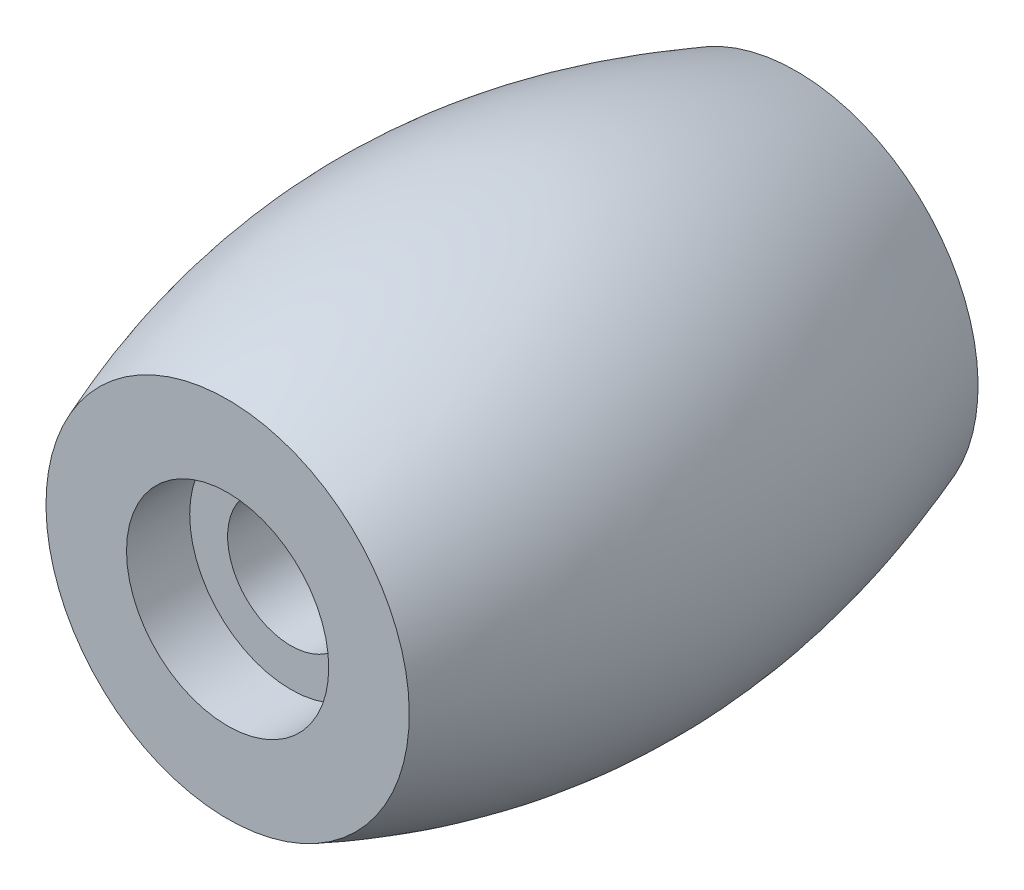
ISO-10303-21;
HEADER;
FILE_DESCRIPTION(('STEP AP214'),'2;1');
FILE_NAME('part.step','',(''),(''),'','','');
FILE_SCHEMA(('AUTOMOTIVE_DESIGN { 1 0 10303 214 1 1 1 1 }'));
ENDSEC;
DATA;
#1=APPLICATION_CONTEXT('core data for automotive mechanical design processes');
#2=APPLICATION_PROTOCOL_DEFINITION('international standard','automotive_design',2000,#1);
#3=PRODUCT_CONTEXT('',#1,'mechanical');
#4=PRODUCT('Part','Part','',(#3));
#5=PRODUCT_RELATED_PRODUCT_CATEGORY('part','',(#4));
#6=PRODUCT_DEFINITION_FORMATION('','',#4);
#7=PRODUCT_DEFINITION_CONTEXT('part definition',#1,'design');
#8=PRODUCT_DEFINITION('design','',#6,#7);
#9=PRODUCT_DEFINITION_SHAPE('','',#8);
#10=(LENGTH_UNIT() NAMED_UNIT(*) SI_UNIT(.MILLI.,.METRE.));
#11=(NAMED_UNIT(*) PLANE_ANGLE_UNIT() SI_UNIT($,.RADIAN.));
#12=(NAMED_UNIT(*) SI_UNIT($,.STERADIAN.) SOLID_ANGLE_UNIT());
#13=UNCERTAINTY_MEASURE_WITH_UNIT(LENGTH_MEASURE(1.E-05),#10,'distance_accuracy_value','');
#14=(GEOMETRIC_REPRESENTATION_CONTEXT(3) GLOBAL_UNCERTAINTY_ASSIGNED_CONTEXT((#13)) GLOBAL_UNIT_ASSIGNED_CONTEXT((#10,
#11,#12)) REPRESENTATION_CONTEXT('',''));
#15=CARTESIAN_POINT('',(0.,0.,0.));
#16=DIRECTION('',(0.,0.,1.));
#17=DIRECTION('',(1.,0.,0.));
#18=AXIS2_PLACEMENT_3D('',#15,#16,#17);
#19=CARTESIAN_POINT('',(4.,8.25,-5.5));
#20=DIRECTION('',(0.,0.,1.));
#21=DIRECTION('',(1.,0.,0.));
#22=AXIS2_PLACEMENT_3D('',#19,#20,#21);
#23=CYLINDRICAL_SURFACE('',#22,1.);
#24=CARTESIAN_POINT('',(4.,8.25,3.5));
#25=DIRECTION('',(0.,0.,1.));
#26=DIRECTION('',(1.,0.,0.));
#27=AXIS2_PLACEMENT_3D('',#24,#25,#26);
#28=CIRCLE('',#27,1.);
#29=CARTESIAN_POINT('',(5.,8.25,3.5));
#30=VERTEX_POINT('',#29);
#31=EDGE_CURVE('E104',#30,#30,#28,.F.);
#32=ORIENTED_EDGE('',*,*,#31,.F.);
#33=EDGE_LOOP('',(#32));
#34=FACE_BOUND('',#33,.T.);
#35=CARTESIAN_POINT('',(4.,8.25,-3.5));
#36=DIRECTION('',(0.,0.,-1.));
#37=DIRECTION('',(-1.,0.,0.));
#38=AXIS2_PLACEMENT_3D('',#35,#36,#37);
#39=CIRCLE('',#38,1.);
#40=CARTESIAN_POINT('',(3.,8.25,-3.5));
#41=VERTEX_POINT('',#40);
#42=EDGE_CURVE('E92',#41,#41,#39,.F.);
#43=ORIENTED_EDGE('',*,*,#42,.F.);
#44=EDGE_LOOP('',(#43));
#45=FACE_BOUND('',#44,.T.);
#46=ADVANCED_FACE('F87',(#34,#45),#23,.F.);
#47=CARTESIAN_POINT('',(4.,8.25,-4.5));
#48=DIRECTION('',(0.,0.,1.));
#49=DIRECTION('',(1.,0.,0.));
#50=AXIS2_PLACEMENT_3D('',#47,#48,#49);
#51=PLANE('',#50);
#52=CARTESIAN_POINT('',(4.,8.25,-4.5));
#53=DIRECTION('',(0.,0.,1.));
#54=DIRECTION('',(1.,0.,0.));
#55=AXIS2_PLACEMENT_3D('',#52,#53,#54);
#56=CIRCLE('',#55,1.6);
#57=CARTESIAN_POINT('',(5.6,8.25,-4.5));
#58=VERTEX_POINT('',#57);
#59=EDGE_CURVE('E127',#58,#58,#56,.T.);
#60=ORIENTED_EDGE('',*,*,#59,.T.);
#61=EDGE_LOOP('',(#60));
#62=FACE_BOUND('',#61,.T.);
#63=CARTESIAN_POINT('',(4.,8.25,-4.5));
#64=DIRECTION('',(0.,0.,1.));
#65=DIRECTION('',(1.,0.,0.));
#66=AXIS2_PLACEMENT_3D('',#63,#64,#65);
#67=CIRCLE('',#66,2.87429773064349);
#68=CARTESIAN_POINT('',(5.19432510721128,5.63558324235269,-4.5));
#69=VERTEX_POINT('',#68);
#70=EDGE_CURVE('E11',#69,#69,#67,.T.);
#71=ORIENTED_EDGE('',*,*,#70,.F.);
#72=EDGE_LOOP('',(#71));
#73=FACE_BOUND('',#72,.T.);
#74=ADVANCED_FACE('F89',(#62,#73),#51,.F.);
#75=CARTESIAN_POINT('',(4.,8.25,4.5));
#76=DIRECTION('',(0.,0.,1.));
#77=DIRECTION('',(1.,0.,0.));
#78=AXIS2_PLACEMENT_3D('',#75,#76,#77);
#79=PLANE('',#78);
#80=CARTESIAN_POINT('',(4.,8.25,4.5));
#81=DIRECTION('',(0.,0.,1.));
#82=DIRECTION('',(1.,0.,0.));
#83=AXIS2_PLACEMENT_3D('',#80,#81,#82);
#84=CIRCLE('',#83,1.6);
#85=CARTESIAN_POINT('',(5.6,8.25,4.5));
#86=VERTEX_POINT('',#85);
#87=EDGE_CURVE('E119',#86,#86,#84,.T.);
#88=ORIENTED_EDGE('',*,*,#87,.F.);
#89=EDGE_LOOP('',(#88));
#90=FACE_BOUND('',#89,.T.);
#91=CARTESIAN_POINT('',(4.,8.25,4.5));
#92=DIRECTION('',(0.,0.,1.));
#93=DIRECTION('',(1.,0.,0.));
#94=AXIS2_PLACEMENT_3D('',#91,#92,#93);
#95=CIRCLE('',#94,2.87429773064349);
#96=CARTESIAN_POINT('',(6.02090983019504,6.20610398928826,4.5));
#97=VERTEX_POINT('',#96);
#98=EDGE_CURVE('E97',#97,#97,#95,.T.);
#99=ORIENTED_EDGE('',*,*,#98,.T.);
#100=EDGE_LOOP('',(#99));
#101=FACE_BOUND('',#100,.T.);
#102=ADVANCED_FACE('F148',(#90,#101),#79,.T.);
#103=CARTESIAN_POINT('',(6.02090983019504,6.20610398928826,4.5));
#104=CARTESIAN_POINT('',(6.34296508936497,5.68791517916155,2.99234261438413));
#105=CARTESIAN_POINT('',(6.52667954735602,5.07422380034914,-0.0217139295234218));
#106=CARTESIAN_POINT('',(5.7919086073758,5.30756801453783,-3.00765738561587));
#107=CARTESIAN_POINT('',(5.19432510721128,5.63558324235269,-4.5));
#108=CARTESIAN_POINT('',(5.75336448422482,5.94156752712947,4.5));
#109=CARTESIAN_POINT('',(6.00759965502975,5.38122927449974,2.99234251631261));
#110=CARTESIAN_POINT('',(6.11096171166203,4.74347339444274,-0.0217138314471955));
#111=CARTESIAN_POINT('',(5.40675395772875,5.07301796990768,-3.00765748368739));
#112=CARTESIAN_POINT('',(4.85209877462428,5.47924646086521,-4.5));
#113=CARTESIAN_POINT('',(5.11324565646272,5.51885815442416,4.50000000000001));
#114=CARTESIAN_POINT('',(5.21506756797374,4.90120104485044,2.99234145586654));
#115=CARTESIAN_POINT('',(5.14825749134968,4.24734078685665,-0.0217127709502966));
#116=CARTESIAN_POINT('',(4.54332108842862,4.75701315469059,-3.00765854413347));
#117=CARTESIAN_POINT('',(4.10562462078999,5.3025782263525,-4.5));
#118=CARTESIAN_POINT('',(3.98326975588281,5.30084531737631,4.49999999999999));
#119=CARTESIAN_POINT('',(3.84098632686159,4.69120406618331,2.99234079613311));
#120=CARTESIAN_POINT('',(3.52903888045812,4.11264335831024,-0.0217121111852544));
#121=CARTESIAN_POINT('',(3.1652232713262,4.81507196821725,-3.00765920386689));
#122=CARTESIAN_POINT('',(2.96962552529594,5.48664665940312,-4.5));
#123=CARTESIAN_POINT('',(2.85600716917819,5.53168464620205,4.5));
#124=CARTESIAN_POINT('',(2.49124487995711,5.02291413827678,2.99234192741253));
#125=CARTESIAN_POINT('',(1.98162919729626,4.60778546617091,-0.0217132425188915));
#126=CARTESIAN_POINT('',(1.91430886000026,5.39594522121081,-3.00765807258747));
#127=CARTESIAN_POINT('',(1.99060304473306,6.09123140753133,-4.5));
#128=CARTESIAN_POINT('',(1.90281145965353,6.17641048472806,4.5));
#129=CARTESIAN_POINT('',(1.37111204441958,5.84596081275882,2.99234210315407));
#130=CARTESIAN_POINT('',(0.74142053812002,5.65745854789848,-0.0217134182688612));
#131=CARTESIAN_POINT('',(0.980850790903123,6.41138501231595,-3.00765789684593));
#132=CARTESIAN_POINT('',(1.31741960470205,7.02454674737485,-4.5));
#133=CARTESIAN_POINT('',(1.2689346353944,7.13680475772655,4.50000000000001));
#134=CARTESIAN_POINT('',(0.651253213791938,7.03497944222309,2.99234220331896));
#135=CARTESIAN_POINT('',(-0.00264040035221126,7.10179591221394,-0.0217135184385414));
#136=CARTESIAN_POINT('',(0.507075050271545,7.70670719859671,-3.00765779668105));
#137=CARTESIAN_POINT('',(1.05266738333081,8.14439640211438,-4.5));
#138=CARTESIAN_POINT('',(1.05082430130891,8.26665473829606,4.49999999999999));
#139=CARTESIAN_POINT('',(0.441184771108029,8.40898620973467,2.99234360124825));
#140=CARTESIAN_POINT('',(-0.137375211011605,8.72098074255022,-0.0217149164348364));
#141=CARTESIAN_POINT('',(0.565035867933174,9.08475692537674,-3.00765639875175));
#142=CARTESIAN_POINT('',(1.23660094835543,9.28031080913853,-4.50000000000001));
#143=CARTESIAN_POINT('',(1.28166069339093,9.39400184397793,4.5));
#144=CARTESIAN_POINT('',(0.772921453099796,9.75874989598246,2.99234229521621));
#145=CARTESIAN_POINT('',(0.357824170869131,10.268353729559,-0.0217136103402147));
#146=CARTESIAN_POINT('',(1.14595566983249,10.3356911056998,-3.00765770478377));
#147=CARTESIAN_POINT('',(1.84121201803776,10.2594136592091,-4.49999999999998));
#148=CARTESIAN_POINT('',(1.92642056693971,10.3471646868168,4.5));
#149=CARTESIAN_POINT('',(1.59595827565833,10.8788762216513,2.99234215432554));
#150=CARTESIAN_POINT('',(1.40744213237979,11.5085792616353,-0.0217134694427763));
#151=CARTESIAN_POINT('',(2.16137656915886,11.2691361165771,-3.00765784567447));
#152=CARTESIAN_POINT('',(2.7745480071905,10.9325545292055,-4.50000000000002));
#153=CARTESIAN_POINT('',(2.8868143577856,10.9811035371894,4.5));
#154=CARTESIAN_POINT('',(2.78500125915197,11.598752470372,2.99234185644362));
#155=CARTESIAN_POINT('',(2.85183187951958,12.2526125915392,-0.0217131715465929));
#156=CARTESIAN_POINT('',(3.45673738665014,11.7429268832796,-3.00765814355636));
#157=CARTESIAN_POINT('',(3.89441854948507,11.1973651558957,-4.49999999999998));
#158=CARTESIAN_POINT('',(4.01670000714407,11.199175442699,4.5));
#159=CARTESIAN_POINT('',(4.15897694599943,11.8088208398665,2.99234056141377));
#160=CARTESIAN_POINT('',(4.47091548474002,12.3873842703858,-0.0217118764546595));
#161=CARTESIAN_POINT('',(4.8347457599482,11.6849593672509,-3.00765943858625));
#162=CARTESIAN_POINT('',(5.03035322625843,11.0133832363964,-4.50000000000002));
#163=CARTESIAN_POINT('',(5.14401101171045,10.9683010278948,4.5));
#164=CARTESIAN_POINT('',(5.5087772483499,11.4770685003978,2.9923420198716));
#165=CARTESIAN_POINT('',(6.01839685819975,11.8921939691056,-0.021713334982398));
#166=CARTESIAN_POINT('',(6.08570930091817,11.1040337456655,-3.00765798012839));
#167=CARTESIAN_POINT('',(6.00940909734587,10.4087488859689,-4.49999999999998));
#168=CARTESIAN_POINT('',(6.09717503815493,10.3236031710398,4.5));
#169=CARTESIAN_POINT('',(6.62887232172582,10.6540562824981,2.99234207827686));
#170=CARTESIAN_POINT('',(7.2585626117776,10.8425626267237,-0.0217133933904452));
#171=CARTESIAN_POINT('',(7.01913725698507,10.0886346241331,-3.00765792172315));
#172=CARTESIAN_POINT('',(6.68257241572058,9.47547072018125,-4.50000000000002));
#173=CARTESIAN_POINT('',(6.73107948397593,9.36317690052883,4.5));
#174=CARTESIAN_POINT('',(7.34876201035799,9.46499707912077,2.99234220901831));
#175=CARTESIAN_POINT('',(8.00265457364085,9.39817410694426,-0.021713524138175));
#176=CARTESIAN_POINT('',(7.49293533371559,8.79326691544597,-3.00765779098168));
#177=CARTESIAN_POINT('',(6.94733956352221,8.35558151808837,-4.49999999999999));
#178=CARTESIAN_POINT('',(6.94915528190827,8.23337573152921,4.5));
#179=CARTESIAN_POINT('',(7.5587937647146,8.09105245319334,2.9923436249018));
#180=CARTESIAN_POINT('',(8.13735849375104,7.77906992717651,-0.0217149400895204));
#181=CARTESIAN_POINT('',(7.43495072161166,7.41528484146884,-3.0076563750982));
#182=CARTESIAN_POINT('',(6.76339036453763,7.21972482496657,-4.50000000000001));
#183=CARTESIAN_POINT('',(6.7183769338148,7.10593771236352,4.5));
#184=CARTESIAN_POINT('',(7.22711937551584,6.7411772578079,2.99234204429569));
#185=CARTESIAN_POINT('',(7.64220163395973,6.23154846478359,-0.0217133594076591));
#186=CARTESIAN_POINT('',(6.85406888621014,6.16423114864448,-3.0076579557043));
#187=CARTESIAN_POINT('',(6.1588025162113,6.2405166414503,-4.49999999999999));
#188=CARTESIAN_POINT('',(6.28845517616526,6.47064045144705,4.5));
#189=CARTESIAN_POINT('',(6.67833052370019,5.99460108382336,2.99234271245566));
#190=CARTESIAN_POINT('',(6.94239738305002,5.40497420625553,-0.0217140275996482));
#191=CARTESIAN_POINT('',(6.17706325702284,5.54211805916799,-3.00765728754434));
#192=CARTESIAN_POINT('',(5.53655143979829,5.79192002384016,-4.5));
#193=CARTESIAN_POINT('',(6.02090983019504,6.20610398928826,4.5));
#194=CARTESIAN_POINT('',(6.34296508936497,5.68791517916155,2.99234261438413));
#195=CARTESIAN_POINT('',(6.52667954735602,5.07422380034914,-0.0217139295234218));
#196=CARTESIAN_POINT('',(5.7919086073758,5.30756801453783,-3.00765738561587));
#197=CARTESIAN_POINT('',(5.19432510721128,5.63558324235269,-4.5));
#198=B_SPLINE_SURFACE_WITH_KNOTS('',3,3,((#103,#104,#105,#106,#107),(#108,#109,#110,#111,#112),
(#113,#114,#115,#116,#117),(#118,#119,#120,#121,#122),(#123,#124,#125,#126,#127),(#128,#129,
#130,#131,#132),(#133,#134,#135,#136,#137),(#138,#139,#140,#141,#142),(#143,#144,#145,#146,
#147),(#148,#149,#150,#151,#152),(#153,#154,#155,#156,#157),(#158,#159,#160,#161,#162),(#163,
#164,#165,#166,#167),(#168,#169,#170,#171,#172),(#173,#174,#175,#176,#177),(#178,#179,#180,#181,
#182),(#183,#184,#185,#186,#187),(#188,#189,#190,#191,#192),(#193,#194,#195,#196,#197)),
.UNSPECIFIED.,.T.,.F.,.F.,(4,1,1,1,1,1,1,1,1,1,1,1,1,1,1,1,4),(4,1,4),(0.,0.0625,0.125,0.1875,
0.25,0.3125,0.375,0.4375,0.5,0.5625,0.625,0.6875,0.75,0.8125,0.875,0.9375,1.),(0.,
0.497552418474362,1.),.UNSPECIFIED.);
#199=CARTESIAN_POINT('',(6.02090983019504,6.20610398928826,4.5));
#200=CARTESIAN_POINT('',(6.02343679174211,6.20203809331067,4.48817037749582));
#201=CARTESIAN_POINT('',(6.02595102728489,6.19798292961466,4.47633434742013));
#202=CARTESIAN_POINT('',(6.0309510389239,6.18989886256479,4.45266325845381));
#203=CARTESIAN_POINT('',(6.03343684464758,6.18586993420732,4.44082821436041));
#204=CARTESIAN_POINT('',(6.03837999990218,6.17783833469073,4.41715909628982));
#205=CARTESIAN_POINT('',(6.04083737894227,6.17383563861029,4.40532503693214));
#206=CARTESIAN_POINT('',(6.04572368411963,6.16585650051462,4.38165788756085));
#207=CARTESIAN_POINT('',(6.04815263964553,6.16188003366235,4.36982481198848));
#208=CARTESIAN_POINT('',(6.05298210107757,6.15395335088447,4.34615962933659));
#209=CARTESIAN_POINT('',(6.05538263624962,6.1500031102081,4.33432753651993));
#210=CARTESIAN_POINT('',(6.06015526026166,6.1421288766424,4.31066431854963));
#211=CARTESIAN_POINT('',(6.06252737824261,6.13820485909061,4.2988332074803));
#212=CARTESIAN_POINT('',(6.06724317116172,6.13038306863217,4.27517195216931));
#213=CARTESIAN_POINT('',(6.06958687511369,6.12648527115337,4.26334182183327));
#214=CARTESIAN_POINT('',(6.07424584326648,6.11871591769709,4.23968252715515));
#215=CARTESIAN_POINT('',(6.07656113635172,6.11484433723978,4.2278533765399));
#216=CARTESIAN_POINT('',(6.08116328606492,6.10712741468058,4.20419604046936));
#217=CARTESIAN_POINT('',(6.08345017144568,6.10328204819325,4.19236786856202));
#218=CARTESIAN_POINT('',(6.08799550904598,6.09561755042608,4.16871248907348));
#219=CARTESIAN_POINT('',(6.09025398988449,6.0917983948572,4.15688529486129));
#220=CARTESIAN_POINT('',(6.09474252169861,6.084186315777,4.13323186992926));
#221=CARTESIAN_POINT('',(6.0969726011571,6.08039336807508,4.12140565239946));
#222=CARTESIAN_POINT('',(6.10140433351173,6.07283370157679,4.09775417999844));
#223=CARTESIAN_POINT('',(6.10360601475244,6.06906695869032,4.0859289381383));
#224=CARTESIAN_POINT('',(6.10798095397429,6.06155969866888,4.06227941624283));
#225=CARTESIAN_POINT('',(6.11015424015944,6.05781915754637,4.05045514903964));
#226=CARTESIAN_POINT('',(6.11447239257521,6.05036429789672,4.02680757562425));
#227=CARTESIAN_POINT('',(6.11661728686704,6.04664995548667,4.01498428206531));
#228=CARTESIAN_POINT('',(6.12087865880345,6.03924749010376,3.99133865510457));
#229=CARTESIAN_POINT('',(6.12299516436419,6.03555934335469,3.97951633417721));
#230=CARTESIAN_POINT('',(6.12719976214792,6.02820926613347,3.95587265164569));
#231=CARTESIAN_POINT('',(6.1292878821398,6.02454731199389,3.94405130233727));
#232=CARTESIAN_POINT('',(6.13343571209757,6.01724961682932,3.92040956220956));
#233=CARTESIAN_POINT('',(6.13549544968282,6.01361385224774,3.90858918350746));
#234=CARTESIAN_POINT('',(6.13958651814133,6.00636853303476,3.88494938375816));
#235=CARTESIAN_POINT('',(6.14161787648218,6.00275895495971,3.87312997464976));
#236=CARTESIAN_POINT('',(6.14565218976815,5.99556600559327,3.8494921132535));
#237=CARTESIAN_POINT('',(6.14765517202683,5.99198261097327,3.83767367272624));
#238=CARTESIAN_POINT('',(6.15163273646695,5.98484202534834,3.81403774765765));
#239=CARTESIAN_POINT('',(6.15360734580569,5.98128481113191,3.80222027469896));
#240=CARTESIAN_POINT('',(6.15752816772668,5.97419658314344,3.7785862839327));
#241=CARTESIAN_POINT('',(6.15947440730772,5.97066554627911,3.76676977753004));
#242=CARTESIAN_POINT('',(6.16333849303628,5.96362966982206,3.74313771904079));
#243=CARTESIAN_POINT('',(6.16525636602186,5.96012480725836,3.73132217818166));
#244=CARTESIAN_POINT('',(6.16906372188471,5.9531412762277,3.70769204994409));
#245=CARTESIAN_POINT('',(6.17095323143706,5.94966258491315,3.69587747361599));
#246=CARTESIAN_POINT('',(6.1747038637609,5.94273139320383,3.67224927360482));
#247=CARTESIAN_POINT('',(6.17656501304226,5.93927887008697,3.66043566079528));
#248=CARTESIAN_POINT('',(6.18025892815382,5.93240001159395,3.63680938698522));
#249=CARTESIAN_POINT('',(6.18209172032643,5.92897365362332,3.62499673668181));
#250=CARTESIAN_POINT('',(6.18572892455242,5.92214712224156,3.6013723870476));
#251=CARTESIAN_POINT('',(6.18753336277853,5.9187469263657,3.5895606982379));
#252=CARTESIAN_POINT('',(6.19111386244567,5.91197271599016,3.56593827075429));
#253=CARTESIAN_POINT('',(6.19288994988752,5.90859867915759,3.55412754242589));
#254=CARTESIAN_POINT('',(6.19641375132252,5.90187678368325,3.53050703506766));
#255=CARTESIAN_POINT('',(6.19816149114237,5.89852890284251,3.5186972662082));
#256=CARTESIAN_POINT('',(6.20162860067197,5.89185931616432,3.49507867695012));
#257=CARTESIAN_POINT('',(6.20334799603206,5.88853758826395,3.48326986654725));
#258=CARTESIAN_POINT('',(6.20675841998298,5.88192030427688,3.45965319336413));
#259=CARTESIAN_POINT('',(6.20844947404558,5.87862472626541,3.44784534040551));
#260=CARTESIAN_POINT('',(6.21180321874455,5.87205973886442,3.42423058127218));
#261=CARTESIAN_POINT('',(6.21346593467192,5.86879030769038,3.41242368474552));
#262=CARTESIAN_POINT('',(6.21676300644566,5.86227761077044,3.3888108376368));
#263=CARTESIAN_POINT('',(6.21839738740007,5.85903432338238,3.37700489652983));
#264=CARTESIAN_POINT('',(6.22163779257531,5.85257391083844,3.35339395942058));
#265=CARTESIAN_POINT('',(6.22324384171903,5.84935676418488,3.34158897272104));
#266=CARTESIAN_POINT('',(6.22642758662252,5.84294862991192,3.31797994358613));
#267=CARTESIAN_POINT('',(6.22800530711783,5.8397576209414,3.30617591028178));
#268=CARTESIAN_POINT('',(6.23113239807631,5.83340175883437,3.28256878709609));
#269=CARTESIAN_POINT('',(6.23268179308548,5.83023688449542,3.27076570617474));
#270=CARTESIAN_POINT('',(6.2357522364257,5.82393328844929,3.24716048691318));
#271=CARTESIAN_POINT('',(6.23727330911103,5.82079454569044,3.23535835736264));
#272=CARTESIAN_POINT('',(6.24028711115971,5.81454320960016,3.21175504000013));
#273=CARTESIAN_POINT('',(6.2417798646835,5.81143059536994,3.19995386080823));
#274=CARTESIAN_POINT('',(6.24473703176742,5.80523151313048,3.17635244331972));
#275=CARTESIAN_POINT('',(6.24620146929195,5.8021450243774,3.16455221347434));
#276=CARTESIAN_POINT('',(6.24910200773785,5.79599818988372,3.14095269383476));
#277=CARTESIAN_POINT('',(6.25053813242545,5.79293782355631,3.12915341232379));
#278=CARTESIAN_POINT('',(6.25338204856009,5.78684323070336,3.10555578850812));
#279=CARTESIAN_POINT('',(6.25478986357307,5.78380898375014,3.09375745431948));
#280=CARTESIAN_POINT('',(6.25757716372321,5.77776662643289,3.07016172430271));
#281=CARTESIAN_POINT('',(6.25895667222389,5.77475849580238,3.05836433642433));
#282=CARTESIAN_POINT('',(6.26168736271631,5.76876836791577,3.03477049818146));
#283=CARTESIAN_POINT('',(6.26303856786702,5.76578635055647,3.0229740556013));
#284=CARTESIAN_POINT('',(6.26571265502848,5.75984844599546,2.99938210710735));
#285=CARTESIAN_POINT('',(6.26703555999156,5.75689253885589,2.98758660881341));
#286=CARTESIAN_POINT('',(6.26965305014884,5.75100685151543,2.96399654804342));
#287=CARTESIAN_POINT('',(6.27094765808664,5.74807705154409,2.95220199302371));
#288=CARTESIAN_POINT('',(6.27350855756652,5.74224357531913,2.92861381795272));
#289=CARTESIAN_POINT('',(6.2747748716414,5.73933987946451,2.91682020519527));
#290=CARTESIAN_POINT('',(6.27727918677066,5.73355860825,2.89323391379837));
#291=CARTESIAN_POINT('',(6.27851721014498,5.7306810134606,2.88144124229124));
#292=CARTESIAN_POINT('',(6.28096494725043,5.72495194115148,2.85785683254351));
#293=CARTESIAN_POINT('',(6.28217468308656,5.7221004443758,2.84606510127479));
#294=CARTESIAN_POINT('',(6.28456584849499,5.71642356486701,2.82248257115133));
#295=CARTESIAN_POINT('',(6.28574729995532,5.71359816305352,2.81069177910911));
#296=CARTESIAN_POINT('',(6.28808189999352,5.70797347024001,2.78711112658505));
#297=CARTESIAN_POINT('',(6.28923507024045,5.70517416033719,2.77532127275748));
#298=CARTESIAN_POINT('',(6.29151311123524,5.69960164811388,2.75174249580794));
#299=CARTESIAN_POINT('',(6.29263800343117,5.69682842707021,2.73995357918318));
#300=CARTESIAN_POINT('',(6.29485949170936,5.69130808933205,2.71637667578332));
#301=CARTESIAN_POINT('',(6.2959561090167,5.68856095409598,2.70458869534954));
#302=CARTESIAN_POINT('',(6.29812105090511,5.6830927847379,2.68101366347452));
#303=CARTESIAN_POINT('',(6.29918939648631,5.6803717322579,2.66922661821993));
#304=CARTESIAN_POINT('',(6.30129779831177,5.67495572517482,2.64565345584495));
#305=CARTESIAN_POINT('',(6.30233787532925,5.67226075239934,2.63386734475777));
#306=CARTESIAN_POINT('',(6.30438974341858,5.66689690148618,2.61029604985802));
#307=CARTESIAN_POINT('',(6.3054015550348,5.66422800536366,2.5985108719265));
#308=CARTESIAN_POINT('',(6.30739689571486,5.65891630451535,2.57494144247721));
#309=CARTESIAN_POINT('',(6.30838044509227,5.65627348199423,2.56315719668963));
#310=CARTESIAN_POINT('',(6.31031926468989,5.65101392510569,2.53958963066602));
#311=CARTESIAN_POINT('',(6.31127455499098,5.6483971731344,2.52780631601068));
#312=CARTESIAN_POINT('',(6.31315685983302,5.64318975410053,2.50424061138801));
#313=CARTESIAN_POINT('',(6.31408389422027,5.64059906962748,2.49245822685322));
#314=CARTESIAN_POINT('',(6.31590969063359,5.6354437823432,2.46889438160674));
#315=CARTESIAN_POINT('',(6.31680847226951,5.63287916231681,2.45711292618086));
#316=CARTESIAN_POINT('',(6.31857776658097,5.62777600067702,2.43355093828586));
#317=CARTESIAN_POINT('',(6.31944829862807,5.62523744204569,2.42177041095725));
#318=CARTESIAN_POINT('',(6.32116109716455,5.62018639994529,2.39821027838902));
#319=CARTESIAN_POINT('',(6.32200338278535,5.61767389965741,2.38643067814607));
#320=CARTESIAN_POINT('',(6.32365969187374,5.61267497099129,2.36287239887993));
#321=CARTESIAN_POINT('',(6.3244737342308,5.61018852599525,2.35109372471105));
#322=CARTESIAN_POINT('',(6.32607356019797,5.60524170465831,2.32753729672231));
#323=CARTESIAN_POINT('',(6.32685936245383,5.60278131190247,2.31575954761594));
#324=CARTESIAN_POINT('',(6.32840271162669,5.5978865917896,2.29220496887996));
#325=CARTESIAN_POINT('',(6.32916027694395,5.59545224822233,2.28042814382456));
#326=CARTESIAN_POINT('',(6.3306471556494,5.5906096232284,2.25687541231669));
#327=CARTESIAN_POINT('',(6.33137648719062,5.58820132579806,2.24509951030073));
#328=CARTESIAN_POINT('',(6.33280690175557,5.58341078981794,2.22154862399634));
#329=CARTESIAN_POINT('',(6.33350800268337,5.58102853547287,2.20977364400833));
#330=CARTESIAN_POINT('',(6.33488195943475,5.57629008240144,2.1862246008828));
#331=CARTESIAN_POINT('',(6.33555483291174,5.57393386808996,2.17445054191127));
#332=CARTESIAN_POINT('',(6.33687233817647,5.56924749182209,2.15090333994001));
#333=CARTESIAN_POINT('',(6.33751698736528,5.56691731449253,2.1391302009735));
#334=CARTESIAN_POINT('',(6.33877804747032,5.56228300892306,2.11558483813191));
#335=CARTESIAN_POINT('',(6.33939447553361,5.55997886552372,2.103812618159));
#336=CARTESIAN_POINT('',(6.34059909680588,5.55539662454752,2.08026909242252));
#337=CARTESIAN_POINT('',(6.34118730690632,5.5531185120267,2.06849779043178));
#338=CARTESIAN_POINT('',(6.34233549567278,5.54858832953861,2.04495609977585));
#339=CARTESIAN_POINT('',(6.34289549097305,5.54633624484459,2.0331857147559));
#340=CARTESIAN_POINT('',(6.34398725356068,5.54185811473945,2.00964585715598));
#341=CARTESIAN_POINT('',(6.34451903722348,5.5396320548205,1.99787638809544));
#342=CARTESIAN_POINT('',(6.34555437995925,5.53520597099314,1.974338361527));
#343=CARTESIAN_POINT('',(6.3460579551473,5.53300593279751,1.96256980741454));
#344=CARTESIAN_POINT('',(6.34703688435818,5.52863188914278,1.93903360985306));
#345=CARTESIAN_POINT('',(6.34751225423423,5.52645786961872,1.92726596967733));
#346=CARTESIAN_POINT('',(6.34843477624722,5.52213586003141,1.90373159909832));
#347=CARTESIAN_POINT('',(6.34888194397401,5.51998785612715,1.89196487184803));
#348=CARTESIAN_POINT('',(6.34974806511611,5.5157178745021,1.86843232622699));
#349=CARTESIAN_POINT('',(6.35016703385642,5.51359588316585,1.85666651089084));
#350=CARTESIAN_POINT('',(6.35097676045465,5.50937792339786,1.83313578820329));
#351=CARTESIAN_POINT('',(6.35136753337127,5.50728194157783,1.82137088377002));
#352=CARTESIAN_POINT('',(6.35212087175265,5.50311599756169,1.79784198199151));
#353=CARTESIAN_POINT('',(6.35248345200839,5.50104602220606,1.78607798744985));
#354=CARTESIAN_POINT('',(6.35318040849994,5.49693208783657,1.76255090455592));
#355=CARTESIAN_POINT('',(6.35351479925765,5.49488811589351,1.75078781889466));
#356=CARTESIAN_POINT('',(6.35415538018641,5.49082618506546,1.72726255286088));
#357=CARTESIAN_POINT('',(6.35446158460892,5.48880821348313,1.7155003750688));
#358=CARTESIAN_POINT('',(6.35504579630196,5.4847982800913,1.69197692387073));
#359=CARTESIAN_POINT('',(6.35532381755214,5.48280630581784,1.68021565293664));
#360=CARTESIAN_POINT('',(6.35585166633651,5.47884836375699,1.65669401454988));
#361=CARTESIAN_POINT('',(6.35610150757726,5.47688238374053,1.64493364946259));
#362=CARTESIAN_POINT('',(6.35657299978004,5.47297642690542,1.62141382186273));
#363=CARTESIAN_POINT('',(6.35679466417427,5.47103643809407,1.6096543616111));
#364=CARTESIAN_POINT('',(6.35720980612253,5.46718246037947,1.58613634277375));
#365=CARTESIAN_POINT('',(6.35740329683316,5.46526845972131,1.57437778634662));
#366=CARTESIAN_POINT('',(6.357762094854,5.46146645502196,1.55086157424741));
#367=CARTESIAN_POINT('',(6.357927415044,5.45957843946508,1.53910392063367));
#368=CARTESIAN_POINT('',(6.35822987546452,5.45582840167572,1.51558951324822));
#369=CARTESIAN_POINT('',(6.35836702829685,5.45396636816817,1.50383276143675));
#370=CARTESIAN_POINT('',(6.35861315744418,5.45026829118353,1.48032015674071));
#371=CARTESIAN_POINT('',(6.35872214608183,5.44843223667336,1.46856430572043));
#372=CARTESIAN_POINT('',(6.35891195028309,5.44478611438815,1.44505350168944));
#373=CARTESIAN_POINT('',(6.35899277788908,5.44297603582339,1.43329855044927));
#374=CARTESIAN_POINT('',(6.3591262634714,5.43938186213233,1.40978954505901));
#375=CARTESIAN_POINT('',(6.35917893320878,5.43759775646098,1.39803549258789));
#376=CARTESIAN_POINT('',(6.3592561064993,5.43405552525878,1.37452828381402));
#377=CARTESIAN_POINT('',(6.35928062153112,5.43229738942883,1.36277512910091));
#378=CARTESIAN_POINT('',(6.35930148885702,5.42880709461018,1.33926971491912));
#379=CARTESIAN_POINT('',(6.35929785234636,5.4270749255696,1.32751745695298));
#380=CARTESIAN_POINT('',(6.3592624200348,5.42363656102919,1.30401383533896));
#381=CARTESIAN_POINT('',(6.35923063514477,5.42193035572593,1.29226247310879));
#382=CARTESIAN_POINT('',(6.35913890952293,5.41854391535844,1.26876064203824));
#383=CARTESIAN_POINT('',(6.35907897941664,5.41686367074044,1.25701017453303));
#384=CARTESIAN_POINT('',(6.35893096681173,5.41352914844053,1.23351013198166));
#385=CARTESIAN_POINT('',(6.35884289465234,5.41187486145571,1.22176055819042));
#386=CARTESIAN_POINT('',(6.35863860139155,5.40859225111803,1.19826230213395));
#387=CARTESIAN_POINT('',(6.35852239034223,5.40696391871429,1.18651362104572));
#388=CARTESIAN_POINT('',(6.35826182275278,5.4037332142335,1.16301714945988));
#389=CARTESIAN_POINT('',(6.35811747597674,5.40213083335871,1.15126936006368));
#390=CARTESIAN_POINT('',(6.35780064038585,5.39895202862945,1.12777467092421));
#391=CARTESIAN_POINT('',(6.35762816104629,5.39737559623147,1.1160277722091));
#392=CARTESIAN_POINT('',(6.35725506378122,5.39424868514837,1.09253486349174));
#393=CARTESIAN_POINT('',(6.35705445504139,5.39269819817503,1.08078885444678));
#394=CARTESIAN_POINT('',(6.35662510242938,5.38962317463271,1.05729772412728));
#395=CARTESIAN_POINT('',(6.35639636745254,5.38809863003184,1.04555260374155));
#396=CARTESIAN_POINT('',(6.35591076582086,5.38507548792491,1.02206324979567));
#397=CARTESIAN_POINT('',(6.3556539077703,5.3835768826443,1.01031901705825));
#398=CARTESIAN_POINT('',(6.35511206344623,5.38060561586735,0.986831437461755));
#399=CARTESIAN_POINT('',(6.35482708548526,5.37913294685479,0.975088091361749));
#400=CARTESIAN_POINT('',(6.35422900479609,5.37621354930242,0.951602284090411));
#401=CARTESIAN_POINT('',(6.35391591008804,5.37476681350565,0.939859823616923));
#402=CARTESIAN_POINT('',(6.35326159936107,5.37189927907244,0.916375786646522));
#403=CARTESIAN_POINT('',(6.35292039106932,5.37047847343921,0.904634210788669));
#404=CARTESIAN_POINT('',(6.35220985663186,5.36766279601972,0.88115194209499));
#405=CARTESIAN_POINT('',(6.35184053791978,5.36626791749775,0.869411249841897));
#406=CARTESIAN_POINT('',(6.35107378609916,5.36350409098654,0.845930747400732));
#407=CARTESIAN_POINT('',(6.35067636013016,5.36213513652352,0.834190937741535));
#408=CARTESIAN_POINT('',(6.34985339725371,5.35942315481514,0.810712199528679));
#409=CARTESIAN_POINT('',(6.34942786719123,5.35808012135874,0.798973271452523));
#410=CARTESIAN_POINT('',(6.34854869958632,5.35541997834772,0.775496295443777));
#411=CARTESIAN_POINT('',(6.34809506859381,5.3541028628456,0.763758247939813));
#412=CARTESIAN_POINT('',(6.34715970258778,5.35149455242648,0.740283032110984));
#413=CARTESIAN_POINT('',(6.34667797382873,5.35020335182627,0.728545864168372));
#414=CARTESIAN_POINT('',(6.34568641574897,5.34764686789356,0.705072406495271));
#415=CARTESIAN_POINT('',(6.34517659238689,5.34638157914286,0.693336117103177));
#416=CARTESIAN_POINT('',(6.34412884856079,5.34387691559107,0.669864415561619));
#417=CARTESIAN_POINT('',(6.3435909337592,5.34263753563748,0.658129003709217));
#418=CARTESIAN_POINT('',(6.34248701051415,5.34018468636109,0.634659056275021));
#419=CARTESIAN_POINT('',(6.34192100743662,5.33897121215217,0.62292452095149));
#420=CARTESIAN_POINT('',(6.34076091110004,5.33657017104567,0.599456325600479));
#421=CARTESIAN_POINT('',(6.34016682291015,5.33538259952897,0.587722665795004));
#422=CARTESIAN_POINT('',(6.33895055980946,5.33303336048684,0.564256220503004));
#423=CARTESIAN_POINT('',(6.33832838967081,5.33187168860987,0.552523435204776));
#424=CARTESIAN_POINT('',(6.33705596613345,5.32957424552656,0.529058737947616));
#425=CARTESIAN_POINT('',(6.33640571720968,5.32843847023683,0.51732682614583));
#426=CARTESIAN_POINT('',(6.33507713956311,5.3261928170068,0.49386387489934));
#427=CARTESIAN_POINT('',(6.33439881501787,5.32508293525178,0.482132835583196));
#428=CARTESIAN_POINT('',(6.33301408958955,5.32288906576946,0.458671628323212));
#429=CARTESIAN_POINT('',(6.33230769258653,5.32180507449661,0.446941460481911));
#430=CARTESIAN_POINT('',(6.33086682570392,5.31966298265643,0.423481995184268));
#431=CARTESIAN_POINT('',(6.33013235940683,5.31860487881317,0.411752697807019));
#432=CARTESIAN_POINT('',(6.32863535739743,5.31651455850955,0.388294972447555));
#433=CARTESIAN_POINT('',(6.32787282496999,5.31548233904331,0.376566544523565));
#434=CARTESIAN_POINT('',(6.32631969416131,5.31344378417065,0.353110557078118));
#435=CARTESIAN_POINT('',(6.32552909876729,5.3124374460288,0.3413829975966));
#436=CARTESIAN_POINT('',(6.32391984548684,5.3104506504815,0.317928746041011));
#437=CARTESIAN_POINT('',(6.32310119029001,5.30947019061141,0.306202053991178));
#438=CARTESIAN_POINT('',(6.32143582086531,5.30753514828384,0.282749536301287));
#439=CARTESIAN_POINT('',(6.32058910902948,5.30658056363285,0.271023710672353));
#440=CARTESIAN_POINT('',(6.31886762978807,5.30469726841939,0.247572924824));
#441=CARTESIAN_POINT('',(6.31799286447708,5.30376855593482,0.235847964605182));
#442=CARTESIAN_POINT('',(6.31621528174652,5.30193700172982,0.212398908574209));
#443=CARTESIAN_POINT('',(6.31531246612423,5.30103415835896,0.200674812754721));
#444=CARTESIAN_POINT('',(6.31347878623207,5.29925433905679,0.177227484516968));
#445=CARTESIAN_POINT('',(6.31254792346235,5.29837736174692,0.165504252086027));
#446=CARTESIAN_POINT('',(6.3106581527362,5.29664927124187,0.142058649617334));
#447=CARTESIAN_POINT('',(6.309699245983,5.29579815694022,0.130336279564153));
#448=CARTESIAN_POINT('',(6.30775339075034,5.29412178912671,0.106892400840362));
#449=CARTESIAN_POINT('',(6.30676644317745,5.29329653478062,0.0951708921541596));
#450=CARTESIAN_POINT('',(6.30476450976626,5.29167188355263,0.0717287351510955));
#451=CARTESIAN_POINT('',(6.30374952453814,5.29087248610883,0.0600080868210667));
#452=CARTESIAN_POINT('',(6.30169151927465,5.28929954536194,0.0365676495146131));
#453=CARTESIAN_POINT('',(6.3006484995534,5.28852600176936,0.0248478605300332));
#454=CARTESIAN_POINT('',(6.29853442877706,5.28700476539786,0.00140914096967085));
#455=CARTESIAN_POINT('',(6.2974633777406,5.28625707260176,-0.0103097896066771));
#456=CARTESIAN_POINT('',(6.2952932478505,5.28478753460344,-0.0337467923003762));
#457=CARTESIAN_POINT('',(6.29419416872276,5.28406568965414,-0.0454648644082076));
#458=CARTESIAN_POINT('',(6.2919679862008,5.28264784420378,-0.0689001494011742));
#459=CARTESIAN_POINT('',(6.29084088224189,5.28195184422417,-0.0806173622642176));
#460=CARTESIAN_POINT('',(6.28855865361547,5.28058568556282,-0.104050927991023));
#461=CARTESIAN_POINT('',(6.28740352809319,5.27991552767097,-0.115767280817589));
#462=CARTESIAN_POINT('',(6.28506525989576,5.27860105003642,-0.139199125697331));
#463=CARTESIAN_POINT('',(6.28388211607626,5.27795673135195,-0.150914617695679));
#464=CARTESIAN_POINT('',(6.28148781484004,5.27669392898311,-0.174344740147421));
#465=CARTESIAN_POINT('',(6.28027665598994,5.2760754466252,-0.186059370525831));
#466=CARTESIAN_POINT('',(6.27782632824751,5.27486431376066,-0.209487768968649));
#467=CARTESIAN_POINT('',(6.27658715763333,5.27427166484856,-0.221201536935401));
#468=CARTESIAN_POINT('',(6.27408080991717,5.27311219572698,-0.244628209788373));
#469=CARTESIAN_POINT('',(6.27281363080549,5.27254537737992,-0.256341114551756));
#470=CARTESIAN_POINT('',(6.27025126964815,5.27143756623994,-0.279766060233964));
#471=CARTESIAN_POINT('',(6.26895608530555,5.27089657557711,-0.291478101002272));
#472=CARTESIAN_POINT('',(6.26633771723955,5.26984041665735,-0.314901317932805));
#473=CARTESIAN_POINT('',(6.26501453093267,5.26932525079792,-0.326612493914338));
#474=CARTESIAN_POINT('',(6.26234016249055,5.26832073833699,-0.350033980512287));
#475=CARTESIAN_POINT('',(6.26098897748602,5.26783139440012,-0.361744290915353));
#476=CARTESIAN_POINT('',(6.25825861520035,5.26687852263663,-0.385164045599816));
#477=CARTESIAN_POINT('',(6.25687943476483,5.26641499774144,-0.396873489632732));
#478=CARTESIAN_POINT('',(6.25409308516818,5.26551376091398,-0.420291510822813));
#479=CARTESIAN_POINT('',(6.25268591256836,5.26507605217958,-0.432000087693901));
#480=CARTESIAN_POINT('',(6.24984358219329,5.26422644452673,-0.455416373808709));
#481=CARTESIAN_POINT('',(6.24840842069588,5.26381454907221,-0.467124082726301));
#482=CARTESIAN_POINT('',(6.245510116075,5.26301656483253,-0.490538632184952));
#483=CARTESIAN_POINT('',(6.24404696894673,5.26263047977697,-0.502245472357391));
#484=CARTESIAN_POINT('',(6.24109269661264,5.26188411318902,-0.525658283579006));
#485=CARTESIAN_POINT('',(6.23960156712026,5.26152383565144,-0.537364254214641));
#486=CARTESIAN_POINT('',(6.23659133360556,5.26082908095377,-0.56077532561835));
#487=CARTESIAN_POINT('',(6.23507222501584,5.2604946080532,-0.572480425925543));
#488=CARTESIAN_POINT('',(6.23200603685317,5.25985145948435,-0.59588975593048));
#489=CARTESIAN_POINT('',(6.23045895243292,5.25954278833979,-0.607593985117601));
#490=CARTESIAN_POINT('',(6.2273368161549,5.25895124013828,-0.631001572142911));
#491=CARTESIAN_POINT('',(6.22576175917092,5.25866836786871,-0.642704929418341));
#492=CARTESIAN_POINT('',(6.2225836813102,5.25812841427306,-0.666110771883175));
#493=CARTESIAN_POINT('',(6.22098065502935,5.25787133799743,-0.677813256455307));
#494=CARTESIAN_POINT('',(6.21774664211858,5.25738297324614,-0.701217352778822));
#495=CARTESIAN_POINT('',(6.21611564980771,5.25715169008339,-0.71291896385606));
#496=CARTESIAN_POINT('',(6.21282570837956,5.25671490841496,-0.736321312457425));
#497=CARTESIAN_POINT('',(6.21116675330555,5.25650941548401,-0.748022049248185));
#498=CARTESIAN_POINT('',(6.20782088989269,5.25612421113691,-0.771422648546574));
#499=CARTESIAN_POINT('',(6.20613397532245,5.25594450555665,-0.783122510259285));
#500=CARTESIAN_POINT('',(6.20273219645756,5.25561087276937,-0.806521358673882));
#501=CARTESIAN_POINT('',(6.20101732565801,5.25545695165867,-0.818220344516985));
#502=CARTESIAN_POINT('',(6.19755963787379,5.25517488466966,-0.841617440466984));
#503=CARTESIAN_POINT('',(6.19581681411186,5.25504674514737,-0.853315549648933));
#504=CARTESIAN_POINT('',(6.19230322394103,5.25481623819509,-0.876710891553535));
#505=CARTESIAN_POINT('',(6.19053245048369,5.25471387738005,-0.888408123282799));
#506=CARTESIAN_POINT('',(6.18696296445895,5.25453492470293,-0.911801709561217));
#507=CARTESIAN_POINT('',(6.18516424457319,5.25445833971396,-0.923498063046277));
#508=CARTESIAN_POINT('',(6.18153886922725,5.25433093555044,-0.946889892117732));
#509=CARTESIAN_POINT('',(6.17971220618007,5.25428012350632,-0.958585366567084));
#510=CARTESIAN_POINT('',(6.17603094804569,5.25420426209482,-0.981975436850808));
#511=CARTESIAN_POINT('',(6.1741763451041,5.25417922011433,-0.993670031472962));
#512=CARTESIAN_POINT('',(6.170439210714,5.25415489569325,-1.0170583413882));
#513=CARTESIAN_POINT('',(6.16855667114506,5.25415562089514,-1.02875205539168));
#514=CARTESIAN_POINT('',(6.164763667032,5.2541828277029,-1.05213860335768));
#515=CARTESIAN_POINT('',(6.16285319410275,5.25420931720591,-1.06383143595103));
#516=CARTESIAN_POINT('',(6.1590043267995,5.25428804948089,-1.08721622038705));
#517=CARTESIAN_POINT('',(6.15706592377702,5.25434030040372,-1.09890817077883));
#518=CARTESIAN_POINT('',(6.15316119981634,5.2544705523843,-1.12229119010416));
#519=CARTESIAN_POINT('',(6.15119486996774,5.25454856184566,-1.13398225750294));
#520=CARTESIAN_POINT('',(6.1472342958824,5.25473032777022,-1.15736351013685));
#521=CARTESIAN_POINT('',(6.14524004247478,5.25483409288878,-1.16905369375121));
#522=CARTESIAN_POINT('',(6.14122362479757,5.25506736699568,-1.19243317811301));
#523=CARTESIAN_POINT('',(6.13920145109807,5.2551968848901,-1.20412247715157));
#524=CARTESIAN_POINT('',(6.13512919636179,5.25548166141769,-1.22750019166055));
#525=CARTESIAN_POINT('',(6.13307910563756,5.25563692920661,-1.23918860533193));
#526=CARTESIAN_POINT('',(6.12895102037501,5.25597320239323,-1.26256454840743));
#527=CARTESIAN_POINT('',(6.1268730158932,5.25615421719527,-1.27425207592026));
#528=CARTESIAN_POINT('',(6.1226891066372,5.25654198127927,-1.2976262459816));
#529=CARTESIAN_POINT('',(6.12058319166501,5.25674874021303,-1.30931288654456));
#530=CARTESIAN_POINT('',(6.11634346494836,5.25718798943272,-1.33268528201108));
#531=CARTESIAN_POINT('',(6.11420964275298,5.25742048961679,-1.34437103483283));
#532=CARTESIAN_POINT('',(6.10991410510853,5.25791121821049,-1.3677416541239));
#533=CARTESIAN_POINT('',(6.10775237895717,5.25816945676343,-1.37942651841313));
#534=CARTESIAN_POINT('',(6.10340103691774,5.25871165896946,-1.40279535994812));
#535=CARTESIAN_POINT('',(6.10121141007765,5.25899563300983,-1.41447933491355));
#536=CARTESIAN_POINT('',(6.09680427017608,5.25958930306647,-1.43784639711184));
#537=CARTESIAN_POINT('',(6.09458674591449,5.2598990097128,-1.4495294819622));
#538=CARTESIAN_POINT('',(6.09012381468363,5.26054414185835,-1.47289476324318));
#539=CARTESIAN_POINT('',(6.08787839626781,5.26087957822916,-1.48457695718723));
#540=CARTESIAN_POINT('',(6.08335968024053,5.2615761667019,-1.50794045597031));
#541=CARTESIAN_POINT('',(6.08108637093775,5.26193732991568,-1.51962175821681));
#542=CARTESIAN_POINT('',(6.0765118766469,5.26268536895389,-1.54298347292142));
#543=CARTESIAN_POINT('',(6.07421067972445,5.26307225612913,-1.55466388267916));
#544=CARTESIAN_POINT('',(6.0695804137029,5.26387173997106,-1.57802381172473));
#545=CARTESIAN_POINT('',(6.0672513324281,5.26428434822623,-1.58970332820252));
#546=CARTESIAN_POINT('',(6.06256530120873,5.26513527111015,-1.6130614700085));
#547=CARTESIAN_POINT('',(6.06020833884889,5.2655735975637,-1.62474009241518));
#548=CARTESIAN_POINT('',(6.05546654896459,5.26647595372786,-1.64809644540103));
#549=CARTESIAN_POINT('',(6.05308170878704,5.26693999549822,-1.65977417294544));
#550=CARTESIAN_POINT('',(6.04828416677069,5.26789377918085,-1.68312873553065));
#551=CARTESIAN_POINT('',(6.04587145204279,5.26838353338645,-1.69480556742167));
#552=CARTESIAN_POINT('',(6.04101816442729,5.26938873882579,-1.71815833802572));
#553=CARTESIAN_POINT('',(6.03857757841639,5.26990420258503,-1.72983427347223));
#554=CARTESIAN_POINT('',(6.03366855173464,5.27096082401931,-1.75318525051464));
#555=CARTESIAN_POINT('',(6.0312000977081,5.27150199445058,-1.76486028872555));
#556=CARTESIAN_POINT('',(6.02623533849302,5.27261002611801,-1.78820947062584));
#557=CARTESIAN_POINT('',(6.02373901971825,5.27317690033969,-1.79988361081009));
#558=CARTESIAN_POINT('',(6.01871853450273,5.27433633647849,-1.82323099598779));
#559=CARTESIAN_POINT('',(6.01619435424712,5.27492891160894,-1.83490423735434));
#560=CARTESIAN_POINT('',(6.01111814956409,5.2761397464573,-1.85824982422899));
#561=CARTESIAN_POINT('',(6.00856611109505,5.27675801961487,-1.86992216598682));
#562=CARTESIAN_POINT('',(6.00343419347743,5.27802024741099,-1.893265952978));
#563=CARTESIAN_POINT('',(6.00085430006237,5.27866421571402,-1.9049373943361));
#564=CARTESIAN_POINT('',(5.99566667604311,5.27997783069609,-1.92827937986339));
#565=CARTESIAN_POINT('',(5.99305893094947,5.2806474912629,-1.93994992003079));
#566=CARTESIAN_POINT('',(5.98781560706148,5.28201248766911,-1.96329010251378));
#567=CARTESIAN_POINT('',(5.9851800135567,5.28270783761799,-1.97495974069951));
#568=CARTESIAN_POINT('',(5.97988099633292,5.28412420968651,-1.99829811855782));
#569=CARTESIAN_POINT('',(5.97721755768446,5.28484524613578,-2.00996685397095));
#570=CARTESIAN_POINT('',(5.97186285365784,5.28631298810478,-2.0333034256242));
#571=CARTESIAN_POINT('',(5.96917157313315,5.2870597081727,-2.04497125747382));
#572=CARTESIAN_POINT('',(5.96376118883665,5.28857881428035,-2.06830602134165));
#573=CARTESIAN_POINT('',(5.96104206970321,5.28935121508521,-2.07997294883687));
#574=CARTESIAN_POINT('',(5.95557601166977,5.29092167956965,-2.10330590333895));
#575=CARTESIAN_POINT('',(5.95282905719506,5.2917197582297,-2.11497192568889));
#576=CARTESIAN_POINT('',(5.94730733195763,5.2933415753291,-2.13830306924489));
#577=CARTESIAN_POINT('',(5.94453254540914,5.29416532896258,-2.14996818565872));
#578=CARTESIAN_POINT('',(5.9389551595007,5.29583849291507,-2.17329751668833));
#579=CARTESIAN_POINT('',(5.93615254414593,5.29668791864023,-2.18496172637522));
#580=CARTESIAN_POINT('',(5.93051950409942,5.29841242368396,-2.20828924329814));
#581=CARTESIAN_POINT('',(5.92768906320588,5.299287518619,-2.2199525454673));
#582=CARTESIAN_POINT('',(5.92200037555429,5.3010633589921,-2.24327824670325));
#583=CARTESIAN_POINT('',(5.9191421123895,5.30196412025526,-2.2549406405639));
#584=CARTESIAN_POINT('',(5.91339778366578,5.30379129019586,-2.27826452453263));
#585=CARTESIAN_POINT('',(5.91051170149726,5.30471771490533,-2.28992600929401));
#586=CARTESIAN_POINT('',(5.9047117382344,5.30659620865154,-2.31324807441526));
#587=CARTESIAN_POINT('',(5.90179784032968,5.30754829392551,-2.32490864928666));
#588=CARTESIAN_POINT('',(5.89594224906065,5.30947810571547,-2.3482288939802));
#589=CARTESIAN_POINT('',(5.89300053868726,5.31045584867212,-2.3598885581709));
#590=CARTESIAN_POINT('',(5.88708932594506,5.31243697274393,-2.38320698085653));
#591=CARTESIAN_POINT('',(5.88411980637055,5.31344037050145,-2.39486573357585));
#592=CARTESIAN_POINT('',(5.87815297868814,5.3154728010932,-2.41818233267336));
#593=CARTESIAN_POINT('',(5.87515565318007,5.31650185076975,-2.42984017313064));
#594=CARTESIAN_POINT('',(5.86913321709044,5.31858558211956,-2.45315494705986));
#595=CARTESIAN_POINT('',(5.86610808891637,5.31964028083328,-2.46481187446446));
#596=CARTESIAN_POINT('',(5.86003005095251,5.32177530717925,-2.48812482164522));
#597=CARTESIAN_POINT('',(5.85697712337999,5.3228556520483,-2.49978083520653));
#598=CARTESIAN_POINT('',(5.85084349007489,5.32504196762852,-2.52309195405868));
#599=CARTESIAN_POINT('',(5.8477627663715,5.32614795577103,-2.53474705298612));
#600=CARTESIAN_POINT('',(5.84157354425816,5.32838555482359,-2.55805634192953));
#601=CARTESIAN_POINT('',(5.83846502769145,5.32951718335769,-2.56971052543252));
#602=CARTESIAN_POINT('',(5.83222022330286,5.33180606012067,-2.59301798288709));
#603=CARTESIAN_POINT('',(5.82908391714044,5.33296332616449,-2.6046712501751));
#604=CARTESIAN_POINT('',(5.82278353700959,5.33530347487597,-2.62797687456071));
#605=CARTESIAN_POINT('',(5.81961944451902,5.33648637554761,-2.63962922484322));
#606=CARTESIAN_POINT('',(5.81326349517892,5.33887779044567,-2.66293301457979));
#607=CARTESIAN_POINT('',(5.8100716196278,5.34008632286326,-2.67458444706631));
#608=CARTESIAN_POINT('',(5.80366010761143,5.34252899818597,-2.69788640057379));
#609=CARTESIAN_POINT('',(5.80044045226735,5.34376315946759,-2.70953691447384));
#610=CARTESIAN_POINT('',(5.79397338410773,5.34625708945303,-2.73283703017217));
#611=CARTESIAN_POINT('',(5.79072595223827,5.34751687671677,-2.74448662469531));
#612=CARTESIAN_POINT('',(5.78420333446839,5.35006205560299,-2.76778490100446));
#613=CARTESIAN_POINT('',(5.78092812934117,5.35134746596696,-2.77943357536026));
#614=CARTESIAN_POINT('',(5.77434996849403,5.35394388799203,-2.80273001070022));
#615=CARTESIAN_POINT('',(5.77104699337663,5.35525491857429,-2.81437776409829));
#616=CARTESIAN_POINT('',(5.76441329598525,5.35790257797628,-2.83767235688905));
#617=CARTESIAN_POINT('',(5.76108255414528,5.3592392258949,-2.84931918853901));
#618=CARTESIAN_POINT('',(5.75439332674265,5.36193811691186,-2.87261193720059));
#619=CARTESIAN_POINT('',(5.75103482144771,5.36330037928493,-2.88425784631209));
#620=CARTESIAN_POINT('',(5.74429007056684,5.3660504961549,-2.90754874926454));
#621=CARTESIAN_POINT('',(5.74090380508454,5.36743837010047,-2.91919373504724));
#622=CARTESIAN_POINT('',(5.73410353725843,5.37023970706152,-2.9424827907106));
#623=CARTESIAN_POINT('',(5.73068951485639,5.37165318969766,-2.95412685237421));
#624=CARTESIAN_POINT('',(5.72383373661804,5.37450574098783,-2.97741405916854));
#625=CARTESIAN_POINT('',(5.72039196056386,5.37594482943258,-2.98905719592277));
#626=CARTESIAN_POINT('',(5.71348067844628,5.37884858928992,-3.01234255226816));
#627=CARTESIAN_POINT('',(5.71001115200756,5.38031328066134,-3.02398476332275));
#628=CARTESIAN_POINT('',(5.70304437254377,5.38326824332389,-3.04726826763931));
#629=CARTESIAN_POINT('',(5.69954709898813,5.38475853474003,-3.05890955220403));
#630=CARTESIAN_POINT('',(5.69252482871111,5.38776469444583,-3.08219120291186));
#631=CARTESIAN_POINT('',(5.68899981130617,5.38928058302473,-3.09383156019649));
#632=CARTESIAN_POINT('',(5.68192205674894,5.39233793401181,-3.11711135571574));
#633=CARTESIAN_POINT('',(5.67836929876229,5.39387941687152,-3.12875078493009));
#634=CARTESIAN_POINT('',(5.67123606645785,5.39698795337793,-3.1520287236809));
#635=CARTESIAN_POINT('',(5.66765557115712,5.39855502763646,-3.16366722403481));
#636=CARTESIAN_POINT('',(5.66046686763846,5.40171474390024,-3.18694330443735));
#637=CARTESIAN_POINT('',(5.65685863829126,5.40330740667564,-3.19858087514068));
#638=CARTESIAN_POINT('',(5.6496144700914,5.40651829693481,-3.22185509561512));
#639=CARTESIAN_POINT('',(5.64597850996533,5.40813654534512,-3.23349173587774));
#640=CARTESIAN_POINT('',(5.63867888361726,5.41139860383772,-3.2567640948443));
#641=CARTESIAN_POINT('',(5.63501519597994,5.41304243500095,-3.26839980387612));
#642=CARTESIAN_POINT('',(5.62766011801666,5.41635565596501,-3.291670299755));
#643=CARTESIAN_POINT('',(5.62396870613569,5.41802506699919,-3.30330507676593));
#644=CARTESIAN_POINT('',(5.6165581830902,5.42138944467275,-3.32657370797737));
#645=CARTESIAN_POINT('',(5.61283905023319,5.4230844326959,-3.33820755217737));
#646=CARTESIAN_POINT('',(5.60537308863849,5.42649996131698,-3.36147431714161));
#647=CARTESIAN_POINT('',(5.60162623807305,5.42822052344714,-3.37310722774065));
#648=CARTESIAN_POINT('',(5.59410484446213,5.43168719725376,-3.39637212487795));
#649=CARTESIAN_POINT('',(5.59033027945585,5.43343333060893,-3.40800410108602));
#650=CARTESIAN_POINT('',(5.5827534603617,5.43695114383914,-3.43126712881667));
#651=CARTESIAN_POINT('',(5.57895118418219,5.43872284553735,-3.44289816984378));
#652=CARTESIAN_POINT('',(5.57131894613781,5.44229179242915,-3.46615932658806));
#653=CARTESIAN_POINT('',(5.56748896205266,5.44408905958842,-3.47778943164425));
#654=CARTESIAN_POINT('',(5.55980131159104,5.44770913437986,-3.50104871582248));
#655=CARTESIAN_POINT('',(5.55594362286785,5.4495319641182,-3.5126778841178));
#656=CARTESIAN_POINT('',(5.54820056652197,5.45320316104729,-3.53593529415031));
#657=CARTESIAN_POINT('',(5.54431517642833,5.45505155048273,-3.54756352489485));
#658=CARTESIAN_POINT('',(5.53651672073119,5.4587738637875,-3.57081905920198));
#659=CARTESIAN_POINT('',(5.53260363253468,5.46064781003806,-3.58244635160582));
#660=CARTESIAN_POINT('',(5.52474978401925,5.46442123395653,-3.60570000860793));
#661=CARTESIAN_POINT('',(5.52080900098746,5.46632073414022,-3.61732636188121));
#662=CARTESIAN_POINT('',(5.51289976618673,5.47014526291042,-3.64057813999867));
#663=CARTESIAN_POINT('',(5.50893129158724,5.47207031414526,-3.65220355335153));
#664=CARTESIAN_POINT('',(5.50096667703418,5.47594594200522,-3.67545345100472));
#665=CARTESIAN_POINT('',(5.49697051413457,5.47789654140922,-3.68707792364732));
#666=CARTESIAN_POINT('',(5.48895052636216,5.48182326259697,-3.71032593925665));
#667=CARTESIAN_POINT('',(5.48492667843,5.48379940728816,-3.72194947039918));
#668=CARTESIAN_POINT('',(5.47685132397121,5.48777721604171,-3.74519560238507));
#669=CARTESIAN_POINT('',(5.47279979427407,5.48977890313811,-3.75681819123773));
#670=CARTESIAN_POINT('',(5.46466907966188,5.4938077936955,-3.78006243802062));
#671=CARTESIAN_POINT('',(5.46058987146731,5.49583502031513,-3.79168408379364));
#672=CARTESIAN_POINT('',(5.45240380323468,5.49991498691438,-3.81492644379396));
#673=CARTESIAN_POINT('',(5.44829691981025,5.50196775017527,-3.82654714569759));
#674=CARTESIAN_POINT('',(5.44005550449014,5.5060987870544,-3.84978761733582));
#675=CARTESIAN_POINT('',(5.4359209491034,5.50817708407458,-3.86140737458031));
#676=CARTESIAN_POINT('',(5.42762419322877,5.51235918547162,-3.88464595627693));
#677=CARTESIAN_POINT('',(5.42346196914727,5.51446301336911,-3.89626476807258));
#678=CARTESIAN_POINT('',(5.41510987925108,5.5186961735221,-3.91950145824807));
#679=CARTESIAN_POINT('',(5.41091998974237,5.52082552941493,-3.93111932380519));
#680=CARTESIAN_POINT('',(5.40251257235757,5.5251097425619,-3.95435412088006));
#681=CARTESIAN_POINT('',(5.39829502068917,5.5272646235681,-3.96597103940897));
#682=CARTESIAN_POINT('',(5.38983228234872,5.53159988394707,-3.98920394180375));
#683=CARTESIAN_POINT('',(5.38558707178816,5.53378028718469,-4.00081991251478));
#684=CARTESIAN_POINT('',(5.377069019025,5.5381665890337,-4.02405091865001));
#685=CARTESIAN_POINT('',(5.37279615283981,5.54037251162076,-4.03566594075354));
#686=CARTESIAN_POINT('',(5.36422279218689,5.54480984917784,-4.05889504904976));
#687=CARTESIAN_POINT('',(5.35992227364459,5.54704128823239,-4.07050912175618));
#688=CARTESIAN_POINT('',(5.35129361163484,5.55152965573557,-4.09373633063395));
#689=CARTESIAN_POINT('',(5.34696544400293,5.55378660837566,-4.10534945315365));
#690=CARTESIAN_POINT('',(5.33828148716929,5.55832600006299,-4.12857476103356));
#691=CARTESIAN_POINT('',(5.33392567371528,5.56060846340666,-4.14018693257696));
#692=CARTESIAN_POINT('',(5.32518642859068,5.56519887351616,-4.16341033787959));
#693=CARTESIAN_POINT('',(5.32080297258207,5.56750684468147,-4.17502155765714));
#694=CARTESIAN_POINT('',(5.31200844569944,5.57214826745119,-4.19824305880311));
#695=CARTESIAN_POINT('',(5.30759735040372,5.57448174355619,-4.20985332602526));
#696=CARTESIAN_POINT('',(5.29874754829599,5.57917417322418,-4.23307292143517));
#697=CARTESIAN_POINT('',(5.29430881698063,5.58153315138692,-4.24468223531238));
#698=CARTESIAN_POINT('',(5.28540374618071,5.58627658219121,-4.26789992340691));
#699=CARTESIAN_POINT('',(5.28093738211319,5.58866105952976,-4.27950828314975));
#700=CARTESIAN_POINT('',(5.27197704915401,5.59345548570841,-4.30272406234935));
#701=CARTESIAN_POINT('',(5.26748305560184,5.59586545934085,-4.31433146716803));
#702=CARTESIAN_POINT('',(5.25846746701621,5.60071087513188,-4.33754533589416));
#703=CARTESIAN_POINT('',(5.25394584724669,5.60314634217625,-4.34915178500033));
#704=CARTESIAN_POINT('',(5.24487500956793,5.60804274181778,-4.37236374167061));
#705=CARTESIAN_POINT('',(5.24032576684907,5.61050369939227,-4.38396923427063));
#706=CARTESIAN_POINT('',(5.23119968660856,5.61545107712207,-4.40717927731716));
#707=CARTESIAN_POINT('',(5.22662282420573,5.61793752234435,-4.41878381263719));
#708=CARTESIAN_POINT('',(5.21744150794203,5.62293587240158,-4.44199194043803));
#709=CARTESIAN_POINT('',(5.21283702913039,5.62544780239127,-4.45359551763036));
#710=CARTESIAN_POINT('',(5.20360048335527,5.63049711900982,-4.47680172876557));
#711=CARTESIAN_POINT('',(5.19896839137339,5.63303453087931,-4.48840434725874));
#712=CARTESIAN_POINT('',(5.19432510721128,5.63558324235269,-4.5));
#713=B_SPLINE_CURVE_WITH_KNOTS('',3,(#199,#200,#201,#202,#203,#204,#205,#206,#207,#208,#209,
#210,#211,#212,#213,#214,#215,#216,#217,#218,#219,#220,#221,#222,#223,#224,#225,#226,#227,#228,
#229,#230,#231,#232,#233,#234,#235,#236,#237,#238,#239,#240,#241,#242,#243,#244,#245,#246,#247,
#248,#249,#250,#251,#252,#253,#254,#255,#256,#257,#258,#259,#260,#261,#262,#263,#264,#265,#266,
#267,#268,#269,#270,#271,#272,#273,#274,#275,#276,#277,#278,#279,#280,#281,#282,#283,#284,#285,
#286,#287,#288,#289,#290,#291,#292,#293,#294,#295,#296,#297,#298,#299,#300,#301,#302,#303,#304,
#305,#306,#307,#308,#309,#310,#311,#312,#313,#314,#315,#316,#317,#318,#319,#320,#321,#322,#323,
#324,#325,#326,#327,#328,#329,#330,#331,#332,#333,#334,#335,#336,#337,#338,#339,#340,#341,#342,
#343,#344,#345,#346,#347,#348,#349,#350,#351,#352,#353,#354,#355,#356,#357,#358,#359,#360,#361,
#362,#363,#364,#365,#366,#367,#368,#369,#370,#371,#372,#373,#374,#375,#376,#377,#378,#379,#380,
#381,#382,#383,#384,#385,#386,#387,#388,#389,#390,#391,#392,#393,#394,#395,#396,#397,#398,#399,
#400,#401,#402,#403,#404,#405,#406,#407,#408,#409,#410,#411,#412,#413,#414,#415,#416,#417,#418,
#419,#420,#421,#422,#423,#424,#425,#426,#427,#428,#429,#430,#431,#432,#433,#434,#435,#436,#437,
#438,#439,#440,#441,#442,#443,#444,#445,#446,#447,#448,#449,#450,#451,#452,#453,#454,#455,#456,
#457,#458,#459,#460,#461,#462,#463,#464,#465,#466,#467,#468,#469,#470,#471,#472,#473,#474,#475,
#476,#477,#478,#479,#480,#481,#482,#483,#484,#485,#486,#487,#488,#489,#490,#491,#492,#493,#494,
#495,#496,#497,#498,#499,#500,#501,#502,#503,#504,#505,#506,#507,#508,#509,#510,#511,#512,#513,
#514,#515,#516,#517,#518,#519,#520,#521,#522,#523,#524,#525,#526,#527,#528,#529,#530,#531,#532,
#533,#534,#535,#536,#537,#538,#539,#540,#541,#542,#543,#544,#545,#546,#547,#548,#549,#550,#551,
#552,#553,#554,#555,#556,#557,#558,#559,#560,#561,#562,#563,#564,#565,#566,#567,#568,#569,#570,
#571,#572,#573,#574,#575,#576,#577,#578,#579,#580,#581,#582,#583,#584,#585,#586,#587,#588,#589,
#590,#591,#592,#593,#594,#595,#596,#597,#598,#599,#600,#601,#602,#603,#604,#605,#606,#607,#608,
#609,#610,#611,#612,#613,#614,#615,#616,#617,#618,#619,#620,#621,#622,#623,#624,#625,#626,#627,
#628,#629,#630,#631,#632,#633,#634,#635,#636,#637,#638,#639,#640,#641,#642,#643,#644,#645,#646,
#647,#648,#649,#650,#651,#652,#653,#654,#655,#656,#657,#658,#659,#660,#661,#662,#663,#664,#665,
#666,#667,#668,#669,#670,#671,#672,#673,#674,#675,#676,#677,#678,#679,#680,#681,#682,#683,#684,
#685,#686,#687,#688,#689,#690,#691,#692,#693,#694,#695,#696,#697,#698,#699,#700,#701,#702,#703,
#704,#705,#706,#707,#708,#709,#710,#711,#712),.UNSPECIFIED.,.F.,.F.,(4,2,2,2,2,2,2,2,2,2,2,2,2,
2,2,2,2,2,2,2,2,2,2,2,2,2,2,2,2,2,2,2,2,2,2,2,2,2,2,2,2,2,2,2,2,2,2,2,2,2,2,2,2,2,2,2,2,2,2,2,2,
2,2,2,2,2,2,2,2,2,2,2,2,2,2,2,2,2,2,2,2,2,2,2,2,2,2,2,2,2,2,2,2,2,2,2,2,2,2,2,2,2,2,2,2,2,2,2,2,
2,2,2,2,2,2,2,2,2,2,2,2,2,2,2,2,2,2,2,2,2,2,2,2,2,2,2,2,2,2,2,2,2,2,2,2,2,2,2,2,2,2,2,2,2,2,2,2,
2,2,2,2,2,2,2,2,2,2,2,2,2,2,2,2,2,2,2,2,2,2,2,2,2,2,2,2,2,2,2,2,2,2,2,2,2,2,2,2,2,2,2,2,2,2,2,2,
2,2,2,2,2,2,2,2,2,2,2,2,2,2,2,2,2,2,2,2,2,2,2,2,2,2,2,2,2,2,2,2,2,2,2,2,2,2,2,2,2,2,2,2,2,2,2,2,
2,2,2,4),(0.,0.0382846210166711,0.0765248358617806,0.1147209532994,0.152873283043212,
0.190982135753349,0.229047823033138,0.267070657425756,0.305050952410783,0.342989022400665,
0.380885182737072,0.418739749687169,0.456553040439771,0.494325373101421,0.532057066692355,
0.569748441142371,0.607399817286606,0.645011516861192,0.682583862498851,0.72011717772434,
0.757611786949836,0.795068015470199,0.832486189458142,0.869866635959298,0.907209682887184,
0.94451565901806,0.981784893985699,1.01901771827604,1.05621446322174,1.09337546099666,
1.13050104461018,1.16759154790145,1.20464730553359,1.24166865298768,1.27865592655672,
1.31560946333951,1.35252960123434,1.38941667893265,1.42627103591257,1.46309301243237,
1.49988294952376,1.53664118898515,1.57336807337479,1.61006394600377,1.64672915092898,
1.68336403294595,1.71996893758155,1.75654421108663,1.79309020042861,1.82960725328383,
1.86609571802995,1.90255594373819,1.93898828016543,1.97539307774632,2.01177068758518,
2.04812146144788,2.08444575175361,2.12074391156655,2.15701629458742,2.193263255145,
2.22948514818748,2.26568232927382,2.30185515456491,2.33800398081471,2.37412916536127,
2.41023106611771,2.44631004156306,2.48236645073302,2.51840065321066,2.55441300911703,
2.59040387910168,2.62637362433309,2.66232260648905,2.69825118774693,2.73415973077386,
2.7700485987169,2.80591815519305,2.84176876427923,2.87760079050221,2.91341459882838,
2.94921055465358,2.9849890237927,3.02075037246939,3.05649496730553,3.09222317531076,
3.12793536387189,3.16363190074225,3.199313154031,3.23497949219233,3.27063128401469,
3.30626889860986,3.34189270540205,3.37750307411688,3.41310037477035,3.44868497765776,
3.48425725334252,3.51981757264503,3.55536630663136,3.59090382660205,3.6264305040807,
3.66194671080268,3.69745281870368,3.73294919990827,3.76843622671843,3.80391427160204,
3.83938370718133,3.87484490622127,3.91029824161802,3.94574408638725,3.98118281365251,
4.01661479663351,4.05204040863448,4.08746002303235,4.12287401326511,4.15828275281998,
4.19368661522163,4.22908597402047,4.26448120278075,4.29987267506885,4.33526076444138,
4.37064584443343,4.4060282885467,4.44140847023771,4.47678676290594,4.51216353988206,
4.54753917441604,4.58291403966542,4.61828850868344,4.65366295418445,4.6890377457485,
4.72441325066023,4.75978983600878,4.79516786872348,4.83054771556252,4.86592974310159,
4.9013143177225,4.93670180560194,4.97209257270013,5.00748698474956,5.0428854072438,
5.07828820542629,5.11369574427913,5.14910838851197,5.18452650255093,5.21995045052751,
5.25538059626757,5.29081730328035,5.32626093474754,5.36171185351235,5.39717042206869,
5.43263700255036,5.46811195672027,5.50359564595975,5.53908843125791,5.574590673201,
5.61010273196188,5.64562496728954,5.68115773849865,5.71670140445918,5.75225632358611,
5.78782285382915,5.82340135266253,5.85899217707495,5.89459568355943,5.93021222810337,
5.96584216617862,6.00148585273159,6.03714364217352,6.07281588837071,6.10850294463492,
6.1442051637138,6.17992289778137,6.21565649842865,6.25140631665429,6.28717270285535,
6.32295600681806,6.35875657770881,6.39457476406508,6.43041091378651,6.46626537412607,
6.50213849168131,6.53803061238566,6.57394208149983,6.60987324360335,6.64582444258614,
6.68179602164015,6.71778832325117,6.75380168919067,6.78983646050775,6.82589297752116,
6.86197157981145,6.8980726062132,6.93419639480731,6.97034328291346,7.00651360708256,
7.04270770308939,7.0789259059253,7.11516854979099,7.15143596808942,7.18772849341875,
7.22404645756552,7.26039019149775,7.29676002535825,7.33315628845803,7.36957930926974,
7.40602941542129,7.44250693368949,7.47901218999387,7.51554550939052,7.55210721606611,
7.58869763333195,7.62531708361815,7.66196588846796,7.69864436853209,7.73535284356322,
7.77209163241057,7.80886105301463,7.84566142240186,7.88249305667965,7.91935627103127,
7.95625137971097,7.99317869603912,8.03013853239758,8.06713120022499,8.10415701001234,
8.14121627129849,8.17830929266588,8.21543638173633,8.25259784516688,8.28979398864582,
8.3270251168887,8.36429153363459,8.40159354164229,8.43893144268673,8.47630553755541,
8.51371612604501,8.55116350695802,8.58864797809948,8.62616983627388,8.66372937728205,
8.70132689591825,8.73896268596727,8.77663704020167,8.8143502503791,8.85210260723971,
8.88989440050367,8.92772591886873,8.96559745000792,9.00350928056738,9.04146169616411,
9.07945498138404,9.11748941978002,9.15556529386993,9.19368288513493,9.23184247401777,
9.27004433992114,9.30828876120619),.UNSPECIFIED.);
#714=EDGE_CURVE('BSEAM136',#97,#69,#713,.T.);
#715=ORIENTED_EDGE('',*,*,#98,.F.);
#716=ORIENTED_EDGE('',*,*,#70,.T.);
#717=ORIENTED_EDGE('',*,*,#714,.T.);
#718=ORIENTED_EDGE('',*,*,#714,.F.);
#719=EDGE_LOOP('',(#715,#717,#716,#718));
#720=FACE_BOUND('',#719,.T.);
#721=ADVANCED_FACE('F136',(#720),#198,.T.);
#722=CARTESIAN_POINT('',(4.,8.25,3.5));
#723=DIRECTION('',(0.,0.,1.));
#724=DIRECTION('',(1.,0.,0.));
#725=AXIS2_PLACEMENT_3D('',#722,#723,#724);
#726=PLANE('',#725);
#727=CARTESIAN_POINT('',(4.,8.25,3.5));
#728=DIRECTION('',(0.,0.,1.));
#729=DIRECTION('',(1.,0.,0.));
#730=AXIS2_PLACEMENT_3D('',#727,#728,#729);
#731=CIRCLE('',#730,1.6);
#732=CARTESIAN_POINT('',(5.6,8.25,3.5));
#733=VERTEX_POINT('',#732);
#734=EDGE_CURVE('E114',#733,#733,#731,.T.);
#735=ORIENTED_EDGE('',*,*,#734,.T.);
#736=EDGE_LOOP('',(#735));
#737=FACE_BOUND('',#736,.T.);
#738=ORIENTED_EDGE('',*,*,#31,.T.);
#739=EDGE_LOOP('',(#738));
#740=FACE_BOUND('',#739,.T.);
#741=ADVANCED_FACE('F147',(#737,#740),#726,.T.);
#742=CARTESIAN_POINT('',(4.,8.25,3.5));
#743=DIRECTION('',(0.,0.,1.));
#744=DIRECTION('',(1.,0.,0.));
#745=AXIS2_PLACEMENT_3D('',#742,#743,#744);
#746=CYLINDRICAL_SURFACE('',#745,1.6);
#747=ORIENTED_EDGE('',*,*,#734,.F.);
#748=EDGE_LOOP('',(#747));
#749=FACE_BOUND('',#748,.T.);
#750=ORIENTED_EDGE('',*,*,#87,.T.);
#751=EDGE_LOOP('',(#750));
#752=FACE_BOUND('',#751,.T.);
#753=ADVANCED_FACE('F202',(#749,#752),#746,.F.);
#754=CARTESIAN_POINT('',(4.,8.25,-3.5));
#755=DIRECTION('',(0.,0.,-1.));
#756=DIRECTION('',(1.,0.,0.));
#757=AXIS2_PLACEMENT_3D('',#754,#755,#756);
#758=PLANE('',#757);
#759=CARTESIAN_POINT('',(4.,8.25,-3.5));
#760=DIRECTION('',(0.,0.,1.));
#761=DIRECTION('',(1.,0.,0.));
#762=AXIS2_PLACEMENT_3D('',#759,#760,#761);
#763=CIRCLE('',#762,1.6);
#764=CARTESIAN_POINT('',(5.6,8.25,-3.5));
#765=VERTEX_POINT('',#764);
#766=EDGE_CURVE('E189',#765,#765,#763,.T.);
#767=ORIENTED_EDGE('',*,*,#766,.F.);
#768=EDGE_LOOP('',(#767));
#769=FACE_BOUND('',#768,.T.);
#770=ORIENTED_EDGE('',*,*,#42,.T.);
#771=EDGE_LOOP('',(#770));
#772=FACE_BOUND('',#771,.T.);
#773=ADVANCED_FACE('F198',(#769,#772),#758,.T.);
#774=CARTESIAN_POINT('',(4.,8.25,-3.5));
#775=DIRECTION('',(0.,0.,-1.));
#776=DIRECTION('',(-1.,0.,0.));
#777=AXIS2_PLACEMENT_3D('',#774,#775,#776);
#778=CYLINDRICAL_SURFACE('',#777,1.6);
#779=ORIENTED_EDGE('',*,*,#766,.T.);
#780=EDGE_LOOP('',(#779));
#781=FACE_BOUND('',#780,.T.);
#782=ORIENTED_EDGE('',*,*,#59,.F.);
#783=EDGE_LOOP('',(#782));
#784=FACE_BOUND('',#783,.T.);
#785=ADVANCED_FACE('F201',(#781,#784),#778,.F.);
#786=CLOSED_SHELL('',(#46,#74,#102,#721,#741,#753,#773,#785));
#787=MANIFOLD_SOLID_BREP('B2',#786);
#788=ADVANCED_BREP_SHAPE_REPRESENTATION('',(#18,#787),#14);
#789=SHAPE_DEFINITION_REPRESENTATION(#9,#788);
ENDSEC;
END-ISO-10303-21;
